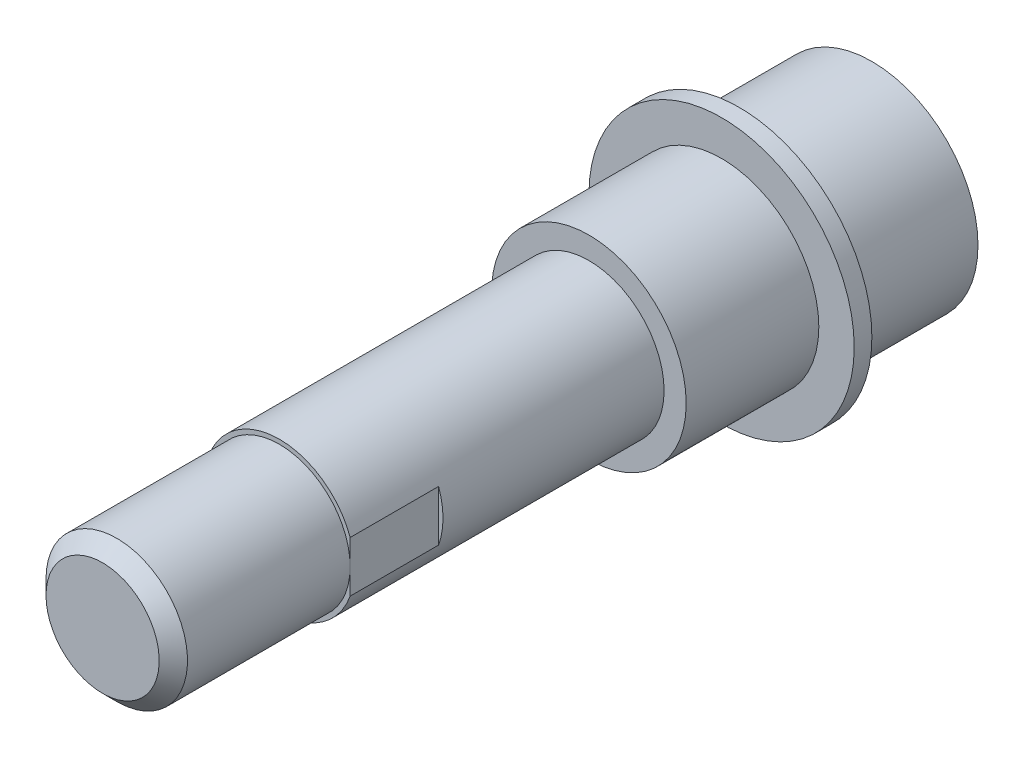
ISO-10303-21;
HEADER;
FILE_DESCRIPTION(('STEP AP214'),'2;1');
FILE_NAME('part.step','',(''),(''),'','','');
FILE_SCHEMA(('AUTOMOTIVE_DESIGN { 1 0 10303 214 1 1 1 1 }'));
ENDSEC;
DATA;
#1=APPLICATION_CONTEXT('core data for automotive mechanical design processes');
#2=APPLICATION_PROTOCOL_DEFINITION('international standard','automotive_design',2000,#1);
#3=PRODUCT_CONTEXT('',#1,'mechanical');
#4=PRODUCT('Part','Part','',(#3));
#5=PRODUCT_RELATED_PRODUCT_CATEGORY('part','',(#4));
#6=PRODUCT_DEFINITION_FORMATION('','',#4);
#7=PRODUCT_DEFINITION_CONTEXT('part definition',#1,'design');
#8=PRODUCT_DEFINITION('design','',#6,#7);
#9=PRODUCT_DEFINITION_SHAPE('','',#8);
#10=(LENGTH_UNIT() NAMED_UNIT(*) SI_UNIT(.MILLI.,.METRE.));
#11=(NAMED_UNIT(*) PLANE_ANGLE_UNIT() SI_UNIT($,.RADIAN.));
#12=(NAMED_UNIT(*) SI_UNIT($,.STERADIAN.) SOLID_ANGLE_UNIT());
#13=UNCERTAINTY_MEASURE_WITH_UNIT(LENGTH_MEASURE(1.E-05),#10,'distance_accuracy_value','');
#14=(GEOMETRIC_REPRESENTATION_CONTEXT(3) GLOBAL_UNCERTAINTY_ASSIGNED_CONTEXT((#13)) GLOBAL_UNIT_ASSIGNED_CONTEXT((#10,
#11,#12)) REPRESENTATION_CONTEXT('',''));
#15=CARTESIAN_POINT('',(0.,0.,0.));
#16=DIRECTION('',(0.,0.,1.));
#17=DIRECTION('',(1.,0.,0.));
#18=AXIS2_PLACEMENT_3D('',#15,#16,#17);
#19=CARTESIAN_POINT('',(0.,8.,-20.));
#20=DIRECTION('',(0.,0.,-1.));
#21=DIRECTION('',(-1.,0.,0.));
#22=AXIS2_PLACEMENT_3D('',#19,#20,#21);
#23=PLANE('',#22);
#24=DIRECTION('',(0.,-1.,0.));
#25=VECTOR('',#24,1.);
#26=CARTESIAN_POINT('',(-8.,2.87228132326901,-20.));
#27=LINE('',#26,#25);
#28=CARTESIAN_POINT('',(-8.,0.,-20.));
#29=VERTEX_POINT('',#28);
#30=CARTESIAN_POINT('',(-8.,-2.87228132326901,-20.));
#31=VERTEX_POINT('',#30);
#32=EDGE_CURVE('E321',#29,#31,#27,.T.);
#33=ORIENTED_EDGE('',*,*,#32,.T.);
#34=CARTESIAN_POINT('',(0.,0.,-20.));
#35=DIRECTION('',(0.,0.,1.));
#36=DIRECTION('',(1.,0.,0.));
#37=AXIS2_PLACEMENT_3D('',#34,#35,#36);
#38=CIRCLE('',#37,8.5);
#39=CARTESIAN_POINT('',(8.,-2.87228132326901,-20.));
#40=VERTEX_POINT('',#39);
#41=EDGE_CURVE('E93',#31,#40,#38,.T.);
#42=ORIENTED_EDGE('',*,*,#41,.T.);
#43=DIRECTION('',(0.,-1.,0.));
#44=VECTOR('',#43,1.);
#45=CARTESIAN_POINT('',(8.,2.87228132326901,-20.));
#46=LINE('',#45,#44);
#47=CARTESIAN_POINT('',(8.,0.,-20.));
#48=VERTEX_POINT('',#47);
#49=EDGE_CURVE('E95',#48,#40,#46,.T.);
#50=ORIENTED_EDGE('',*,*,#49,.F.);
#51=CARTESIAN_POINT('',(0.,0.,-20.));
#52=DIRECTION('',(0.,0.,1.));
#53=DIRECTION('',(1.,0.,0.));
#54=AXIS2_PLACEMENT_3D('',#51,#52,#53);
#55=CIRCLE('',#54,8.);
#56=EDGE_CURVE('E133',#29,#48,#55,.T.);
#57=ORIENTED_EDGE('',*,*,#56,.F.);
#58=EDGE_LOOP('',(#33,#42,#50,#57));
#59=FACE_BOUND('',#58,.T.);
#60=ADVANCED_FACE('F32',(#59),#23,.F.);
#61=CARTESIAN_POINT('',(-8.,2.87228132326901,-20.));
#62=VERTEX_POINT('',#61);
#63=EDGE_CURVE('E88',#62,#29,#27,.T.);
#64=ORIENTED_EDGE('',*,*,#63,.T.);
#65=EDGE_CURVE('E134',#48,#29,#55,.T.);
#66=ORIENTED_EDGE('',*,*,#65,.F.);
#67=CARTESIAN_POINT('',(8.,2.87228132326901,-20.));
#68=VERTEX_POINT('',#67);
#69=EDGE_CURVE('E101',#68,#48,#46,.T.);
#70=ORIENTED_EDGE('',*,*,#69,.F.);
#71=EDGE_CURVE('E130',#68,#62,#38,.T.);
#72=ORIENTED_EDGE('',*,*,#71,.T.);
#73=EDGE_LOOP('',(#64,#66,#70,#72));
#74=FACE_BOUND('',#73,.T.);
#75=ADVANCED_FACE('F157',(#74),#23,.F.);
#76=CARTESIAN_POINT('',(0.,0.,0.));
#77=DIRECTION('',(0.,0.,1.));
#78=DIRECTION('',(1.,0.,0.));
#79=AXIS2_PLACEMENT_3D('',#76,#77,#78);
#80=CYLINDRICAL_SURFACE('',#79,8.5);
#81=CARTESIAN_POINT('',(0.,0.,-55.));
#82=DIRECTION('',(0.,0.,1.));
#83=DIRECTION('',(1.,0.,0.));
#84=AXIS2_PLACEMENT_3D('',#81,#82,#83);
#85=CIRCLE('',#84,8.5);
#86=CARTESIAN_POINT('',(8.5,0.,-55.));
#87=VERTEX_POINT('',#86);
#88=EDGE_CURVE('E127',#87,#87,#85,.T.);
#89=ORIENTED_EDGE('',*,*,#88,.T.);
#90=EDGE_LOOP('',(#89));
#91=FACE_BOUND('',#90,.T.);
#92=DIRECTION('',(0.,0.,1.));
#93=VECTOR('',#92,1.);
#94=CARTESIAN_POINT('',(-8.,-2.87228132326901,-30.));
#95=LINE('',#94,#93);
#96=CARTESIAN_POINT('',(-8.,-2.87228132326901,-30.));
#97=VERTEX_POINT('',#96);
#98=EDGE_CURVE('E80',#97,#31,#95,.T.);
#99=ORIENTED_EDGE('',*,*,#98,.F.);
#100=CARTESIAN_POINT('',(0.,0.,-30.));
#101=DIRECTION('',(0.,0.,-1.));
#102=DIRECTION('',(-1.,0.,0.));
#103=AXIS2_PLACEMENT_3D('',#100,#101,#102);
#104=CIRCLE('',#103,8.5);
#105=CARTESIAN_POINT('',(-8.,2.87228132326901,-30.));
#106=VERTEX_POINT('',#105);
#107=EDGE_CURVE('E84',#97,#106,#104,.T.);
#108=ORIENTED_EDGE('',*,*,#107,.T.);
#109=DIRECTION('',(0.,0.,1.));
#110=VECTOR('',#109,1.);
#111=CARTESIAN_POINT('',(-8.,2.87228132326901,-30.));
#112=LINE('',#111,#110);
#113=EDGE_CURVE('E47',#106,#62,#112,.T.);
#114=ORIENTED_EDGE('',*,*,#113,.T.);
#115=ORIENTED_EDGE('',*,*,#71,.F.);
#116=DIRECTION('',(0.,0.,1.));
#117=VECTOR('',#116,1.);
#118=CARTESIAN_POINT('',(8.,2.87228132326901,-30.));
#119=LINE('',#118,#117);
#120=CARTESIAN_POINT('',(8.,2.87228132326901,-30.));
#121=VERTEX_POINT('',#120);
#122=EDGE_CURVE('E103',#121,#68,#119,.T.);
#123=ORIENTED_EDGE('',*,*,#122,.F.);
#124=CARTESIAN_POINT('',(0.,0.,-30.));
#125=DIRECTION('',(0.,0.,1.));
#126=DIRECTION('',(1.,0.,0.));
#127=AXIS2_PLACEMENT_3D('',#124,#125,#126);
#128=CIRCLE('',#127,8.5);
#129=CARTESIAN_POINT('',(8.,-2.87228132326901,-30.));
#130=VERTEX_POINT('',#129);
#131=EDGE_CURVE('E99',#130,#121,#128,.T.);
#132=ORIENTED_EDGE('',*,*,#131,.F.);
#133=DIRECTION('',(0.,0.,1.));
#134=VECTOR('',#133,1.);
#135=CARTESIAN_POINT('',(8.,-2.87228132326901,-30.));
#136=LINE('',#135,#134);
#137=EDGE_CURVE('E106',#130,#40,#136,.T.);
#138=ORIENTED_EDGE('',*,*,#137,.T.);
#139=ORIENTED_EDGE('',*,*,#41,.F.);
#140=EDGE_LOOP('',(#99,#108,#114,#115,#123,#132,#138,#139));
#141=FACE_BOUND('',#140,.T.);
#142=ADVANCED_FACE('F91',(#91,#141),#80,.T.);
#143=CARTESIAN_POINT('',(0.,0.,0.));
#144=DIRECTION('',(0.,0.,-1.));
#145=DIRECTION('',(-1.,0.,0.));
#146=AXIS2_PLACEMENT_3D('',#143,#144,#145);
#147=PLANE('',#146);
#148=CARTESIAN_POINT('',(0.,0.,0.));
#149=DIRECTION('',(0.,0.,-1.));
#150=DIRECTION('',(-1.,0.,0.));
#151=AXIS2_PLACEMENT_3D('',#148,#149,#150);
#152=CIRCLE('',#151,6.39999999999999);
#153=CARTESIAN_POINT('',(-6.39999999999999,0.,0.));
#154=VERTEX_POINT('',#153);
#155=EDGE_CURVE('E40',#154,#154,#152,.F.);
#156=ORIENTED_EDGE('',*,*,#155,.T.);
#157=EDGE_LOOP('',(#156));
#158=FACE_BOUND('',#157,.T.);
#159=ADVANCED_FACE('F139',(#158),#147,.F.);
#160=CARTESIAN_POINT('',(0.,0.,0.));
#161=DIRECTION('',(0.,0.,1.));
#162=DIRECTION('',(1.,0.,0.));
#163=AXIS2_PLACEMENT_3D('',#160,#161,#162);
#164=CYLINDRICAL_SURFACE('',#163,8.);
#165=CARTESIAN_POINT('',(0.,0.,-1.60000000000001));
#166=DIRECTION('',(0.,0.,-1.));
#167=DIRECTION('',(-1.,0.,0.));
#168=AXIS2_PLACEMENT_3D('',#165,#166,#167);
#169=CIRCLE('',#168,8.);
#170=CARTESIAN_POINT('',(-8.,0.,-1.60000000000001));
#171=VERTEX_POINT('',#170);
#172=EDGE_CURVE('E11',#171,#171,#169,.T.);
#173=ORIENTED_EDGE('',*,*,#172,.T.);
#174=EDGE_LOOP('',(#173));
#175=FACE_BOUND('',#174,.T.);
#176=ORIENTED_EDGE('',*,*,#65,.T.);
#177=ORIENTED_EDGE('',*,*,#56,.T.);
#178=EDGE_LOOP('',(#176,#177));
#179=FACE_BOUND('',#178,.T.);
#180=ADVANCED_FACE('F167',(#175,#179),#164,.T.);
#181=CARTESIAN_POINT('',(0.,8.5,-55.));
#182=DIRECTION('',(0.,0.,-1.));
#183=DIRECTION('',(-1.,0.,0.));
#184=AXIS2_PLACEMENT_3D('',#181,#182,#183);
#185=PLANE('',#184);
#186=ORIENTED_EDGE('',*,*,#88,.F.);
#187=EDGE_LOOP('',(#186));
#188=FACE_BOUND('',#187,.T.);
#189=CARTESIAN_POINT('',(0.,0.,-55.));
#190=DIRECTION('',(0.,0.,1.));
#191=DIRECTION('',(1.,0.,0.));
#192=AXIS2_PLACEMENT_3D('',#189,#190,#191);
#193=CIRCLE('',#192,11.);
#194=CARTESIAN_POINT('',(11.,0.,-55.));
#195=VERTEX_POINT('',#194);
#196=EDGE_CURVE('E124',#195,#195,#193,.T.);
#197=ORIENTED_EDGE('',*,*,#196,.T.);
#198=EDGE_LOOP('',(#197));
#199=FACE_BOUND('',#198,.T.);
#200=ADVANCED_FACE('F169',(#188,#199),#185,.F.);
#201=CARTESIAN_POINT('',(0.,0.,0.));
#202=DIRECTION('',(0.,0.,1.));
#203=DIRECTION('',(1.,0.,0.));
#204=AXIS2_PLACEMENT_3D('',#201,#202,#203);
#205=CYLINDRICAL_SURFACE('',#204,11.);
#206=ORIENTED_EDGE('',*,*,#196,.F.);
#207=EDGE_LOOP('',(#206));
#208=FACE_BOUND('',#207,.T.);
#209=CARTESIAN_POINT('',(0.,0.,-70.));
#210=DIRECTION('',(0.,0.,1.));
#211=DIRECTION('',(1.,0.,0.));
#212=AXIS2_PLACEMENT_3D('',#209,#210,#211);
#213=CIRCLE('',#212,11.);
#214=CARTESIAN_POINT('',(11.,0.,-70.));
#215=VERTEX_POINT('',#214);
#216=EDGE_CURVE('E121',#215,#215,#213,.T.);
#217=ORIENTED_EDGE('',*,*,#216,.T.);
#218=EDGE_LOOP('',(#217));
#219=FACE_BOUND('',#218,.T.);
#220=ADVANCED_FACE('F182',(#208,#219),#205,.T.);
#221=CARTESIAN_POINT('',(0.,11.,-70.));
#222=DIRECTION('',(0.,0.,-1.));
#223=DIRECTION('',(-1.,0.,0.));
#224=AXIS2_PLACEMENT_3D('',#221,#222,#223);
#225=PLANE('',#224);
#226=ORIENTED_EDGE('',*,*,#216,.F.);
#227=EDGE_LOOP('',(#226));
#228=FACE_BOUND('',#227,.T.);
#229=CARTESIAN_POINT('',(0.,0.,-70.));
#230=DIRECTION('',(0.,0.,1.));
#231=DIRECTION('',(1.,0.,0.));
#232=AXIS2_PLACEMENT_3D('',#229,#230,#231);
#233=CIRCLE('',#232,15.);
#234=CARTESIAN_POINT('',(15.,0.,-70.));
#235=VERTEX_POINT('',#234);
#236=EDGE_CURVE('E118',#235,#235,#233,.T.);
#237=ORIENTED_EDGE('',*,*,#236,.T.);
#238=EDGE_LOOP('',(#237));
#239=FACE_BOUND('',#238,.T.);
#240=ADVANCED_FACE('F187',(#228,#239),#225,.F.);
#241=CARTESIAN_POINT('',(0.,0.,0.));
#242=DIRECTION('',(0.,0.,1.));
#243=DIRECTION('',(1.,0.,0.));
#244=AXIS2_PLACEMENT_3D('',#241,#242,#243);
#245=CYLINDRICAL_SURFACE('',#244,15.);
#246=ORIENTED_EDGE('',*,*,#236,.F.);
#247=EDGE_LOOP('',(#246));
#248=FACE_BOUND('',#247,.T.);
#249=CARTESIAN_POINT('',(0.,0.,-72.));
#250=DIRECTION('',(0.,0.,1.));
#251=DIRECTION('',(1.,0.,0.));
#252=AXIS2_PLACEMENT_3D('',#249,#250,#251);
#253=CIRCLE('',#252,15.);
#254=CARTESIAN_POINT('',(15.,0.,-72.));
#255=VERTEX_POINT('',#254);
#256=EDGE_CURVE('E115',#255,#255,#253,.T.);
#257=ORIENTED_EDGE('',*,*,#256,.T.);
#258=EDGE_LOOP('',(#257));
#259=FACE_BOUND('',#258,.T.);
#260=ADVANCED_FACE('F193',(#248,#259),#245,.T.);
#261=CARTESIAN_POINT('',(0.,15.,-72.));
#262=DIRECTION('',(0.,0.,1.));
#263=DIRECTION('',(1.,0.,0.));
#264=AXIS2_PLACEMENT_3D('',#261,#262,#263);
#265=PLANE('',#264);
#266=ORIENTED_EDGE('',*,*,#256,.F.);
#267=EDGE_LOOP('',(#266));
#268=FACE_BOUND('',#267,.T.);
#269=CARTESIAN_POINT('',(0.,0.,-72.));
#270=DIRECTION('',(0.,0.,1.));
#271=DIRECTION('',(1.,0.,0.));
#272=AXIS2_PLACEMENT_3D('',#269,#270,#271);
#273=CIRCLE('',#272,12.);
#274=CARTESIAN_POINT('',(12.,0.,-72.));
#275=VERTEX_POINT('',#274);
#276=EDGE_CURVE('E112',#275,#275,#273,.T.);
#277=ORIENTED_EDGE('',*,*,#276,.T.);
#278=EDGE_LOOP('',(#277));
#279=FACE_BOUND('',#278,.T.);
#280=ADVANCED_FACE('F199',(#268,#279),#265,.F.);
#281=CARTESIAN_POINT('',(0.,0.,0.));
#282=DIRECTION('',(0.,0.,1.));
#283=DIRECTION('',(1.,0.,0.));
#284=AXIS2_PLACEMENT_3D('',#281,#282,#283);
#285=CYLINDRICAL_SURFACE('',#284,12.);
#286=ORIENTED_EDGE('',*,*,#276,.F.);
#287=EDGE_LOOP('',(#286));
#288=FACE_BOUND('',#287,.T.);
#289=CARTESIAN_POINT('',(0.,0.,-87.));
#290=DIRECTION('',(0.,0.,1.));
#291=DIRECTION('',(1.,0.,0.));
#292=AXIS2_PLACEMENT_3D('',#289,#290,#291);
#293=CIRCLE('',#292,12.);
#294=CARTESIAN_POINT('',(12.,0.,-87.));
#295=VERTEX_POINT('',#294);
#296=EDGE_CURVE('E108',#295,#295,#293,.T.);
#297=ORIENTED_EDGE('',*,*,#296,.T.);
#298=EDGE_LOOP('',(#297));
#299=FACE_BOUND('',#298,.T.);
#300=ADVANCED_FACE('F152',(#288,#299),#285,.T.);
#301=CARTESIAN_POINT('',(0.,12.,-87.));
#302=DIRECTION('',(0.,0.,1.));
#303=DIRECTION('',(1.,0.,0.));
#304=AXIS2_PLACEMENT_3D('',#301,#302,#303);
#305=PLANE('',#304);
#306=ORIENTED_EDGE('',*,*,#296,.F.);
#307=EDGE_LOOP('',(#306));
#308=FACE_BOUND('',#307,.T.);
#309=ADVANCED_FACE('F143',(#308),#305,.F.);
#310=CARTESIAN_POINT('',(0.,0.,0.));
#311=DIRECTION('',(0.,0.,-1.));
#312=DIRECTION('',(-1.,0.,0.));
#313=AXIS2_PLACEMENT_3D('',#310,#311,#312);
#314=CONICAL_SURFACE('',#313,6.39999999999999,0.785398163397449);
#315=ORIENTED_EDGE('',*,*,#172,.F.);
#316=EDGE_LOOP('',(#315));
#317=FACE_BOUND('',#316,.T.);
#318=ORIENTED_EDGE('',*,*,#155,.F.);
#319=EDGE_LOOP('',(#318));
#320=FACE_BOUND('',#319,.T.);
#321=ADVANCED_FACE('F34',(#317,#320),#314,.T.);
#322=CARTESIAN_POINT('',(8.,2.87228132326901,-30.));
#323=DIRECTION('',(-1.,0.,0.));
#324=DIRECTION('',(0.,0.,1.));
#325=AXIS2_PLACEMENT_3D('',#322,#323,#324);
#326=PLANE('',#325);
#327=ORIENTED_EDGE('',*,*,#69,.T.);
#328=ORIENTED_EDGE('',*,*,#49,.T.);
#329=ORIENTED_EDGE('',*,*,#137,.F.);
#330=DIRECTION('',(0.,-1.,0.));
#331=VECTOR('',#330,1.);
#332=CARTESIAN_POINT('',(8.,2.87228132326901,-30.));
#333=LINE('',#332,#331);
#334=EDGE_CURVE('E54',#121,#130,#333,.T.);
#335=ORIENTED_EDGE('',*,*,#334,.F.);
#336=ORIENTED_EDGE('',*,*,#122,.T.);
#337=EDGE_LOOP('',(#327,#328,#329,#335,#336));
#338=FACE_BOUND('',#337,.T.);
#339=ADVANCED_FACE('F142',(#338),#326,.F.);
#340=CARTESIAN_POINT('',(0.,0.,-30.));
#341=DIRECTION('',(0.,0.,1.));
#342=DIRECTION('',(1.,0.,0.));
#343=AXIS2_PLACEMENT_3D('',#340,#341,#342);
#344=PLANE('',#343);
#345=ORIENTED_EDGE('',*,*,#131,.T.);
#346=ORIENTED_EDGE('',*,*,#334,.T.);
#347=EDGE_LOOP('',(#345,#346));
#348=FACE_BOUND('',#347,.T.);
#349=ADVANCED_FACE('F149',(#348),#344,.T.);
#350=CARTESIAN_POINT('',(-8.,2.87228132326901,-30.));
#351=DIRECTION('',(-1.,0.,0.));
#352=DIRECTION('',(0.,0.,1.));
#353=AXIS2_PLACEMENT_3D('',#350,#351,#352);
#354=PLANE('',#353);
#355=ORIENTED_EDGE('',*,*,#63,.F.);
#356=ORIENTED_EDGE('',*,*,#113,.F.);
#357=DIRECTION('',(0.,-1.,0.));
#358=VECTOR('',#357,1.);
#359=CARTESIAN_POINT('',(-8.,2.87228132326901,-30.));
#360=LINE('',#359,#358);
#361=EDGE_CURVE('E76',#106,#97,#360,.T.);
#362=ORIENTED_EDGE('',*,*,#361,.T.);
#363=ORIENTED_EDGE('',*,*,#98,.T.);
#364=ORIENTED_EDGE('',*,*,#32,.F.);
#365=EDGE_LOOP('',(#355,#356,#362,#363,#364));
#366=FACE_BOUND('',#365,.T.);
#367=ADVANCED_FACE('F78',(#366),#354,.T.);
#368=CARTESIAN_POINT('',(0.,0.,-30.));
#369=DIRECTION('',(0.,0.,1.));
#370=DIRECTION('',(-1.,0.,0.));
#371=AXIS2_PLACEMENT_3D('',#368,#369,#370);
#372=PLANE('',#371);
#373=ORIENTED_EDGE('',*,*,#107,.F.);
#374=ORIENTED_EDGE('',*,*,#361,.F.);
#375=EDGE_LOOP('',(#373,#374));
#376=FACE_BOUND('',#375,.T.);
#377=ADVANCED_FACE('F86',(#376),#372,.T.);
#378=CLOSED_SHELL('',(#60,#75,#142,#159,#180,#200,#220,#240,#260,#280,#300,#309,#321,#339,#349,
#367,#377));
#379=MANIFOLD_SOLID_BREP('B2',#378);
#380=ADVANCED_BREP_SHAPE_REPRESENTATION('',(#18,#379),#14);
#381=SHAPE_DEFINITION_REPRESENTATION(#9,#380);
ENDSEC;
END-ISO-10303-21;
